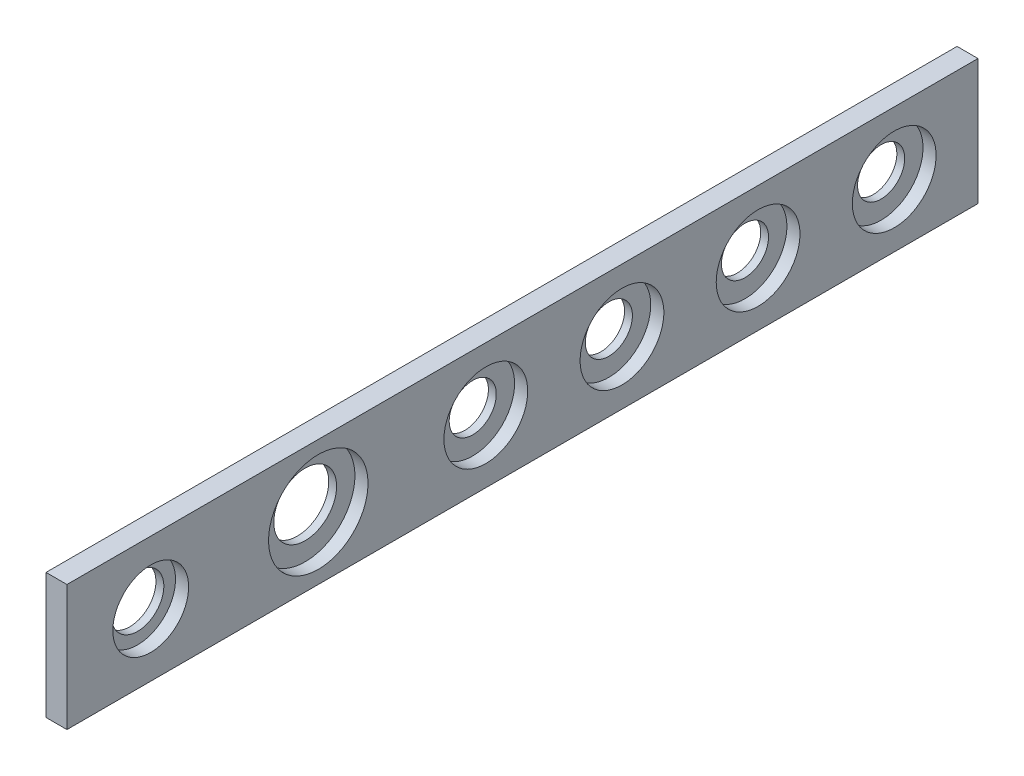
ISO-10303-21;
HEADER;
FILE_DESCRIPTION(('STEP AP214'),'2;1');
FILE_NAME('part.step','',(''),(''),'','','');
FILE_SCHEMA(('AUTOMOTIVE_DESIGN { 1 0 10303 214 1 1 1 1 }'));
ENDSEC;
DATA;
#1=APPLICATION_CONTEXT('core data for automotive mechanical design processes');
#2=APPLICATION_PROTOCOL_DEFINITION('international standard','automotive_design',2000,#1);
#3=PRODUCT_CONTEXT('',#1,'mechanical');
#4=PRODUCT('Part','Part','',(#3));
#5=PRODUCT_RELATED_PRODUCT_CATEGORY('part','',(#4));
#6=PRODUCT_DEFINITION_FORMATION('','',#4);
#7=PRODUCT_DEFINITION_CONTEXT('part definition',#1,'design');
#8=PRODUCT_DEFINITION('design','',#6,#7);
#9=PRODUCT_DEFINITION_SHAPE('','',#8);
#10=(LENGTH_UNIT() NAMED_UNIT(*) SI_UNIT(.MILLI.,.METRE.));
#11=(NAMED_UNIT(*) PLANE_ANGLE_UNIT() SI_UNIT($,.RADIAN.));
#12=(NAMED_UNIT(*) SI_UNIT($,.STERADIAN.) SOLID_ANGLE_UNIT());
#13=UNCERTAINTY_MEASURE_WITH_UNIT(LENGTH_MEASURE(1.E-05),#10,'distance_accuracy_value','');
#14=(GEOMETRIC_REPRESENTATION_CONTEXT(3) GLOBAL_UNCERTAINTY_ASSIGNED_CONTEXT((#13)) GLOBAL_UNIT_ASSIGNED_CONTEXT((#10,
#11,#12)) REPRESENTATION_CONTEXT('',''));
#15=CARTESIAN_POINT('',(0.,0.,0.));
#16=DIRECTION('',(0.,0.,1.));
#17=DIRECTION('',(1.,0.,0.));
#18=AXIS2_PLACEMENT_3D('',#15,#16,#17);
#19=CARTESIAN_POINT('',(0.,0.,1104.9));
#20=DIRECTION('',(0.,-1.,0.));
#21=DIRECTION('',(0.,0.,1.));
#22=AXIS2_PLACEMENT_3D('',#19,#20,#21);
#23=PLANE('',#22);
#24=DIRECTION('',(1.,0.,0.));
#25=VECTOR('',#24,1.);
#26=CARTESIAN_POINT('',(0.,0.,0.));
#27=LINE('',#26,#25);
#28=CARTESIAN_POINT('',(-25.4000000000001,0.,0.));
#29=VERTEX_POINT('',#28);
#30=CARTESIAN_POINT('',(0.,0.,0.));
#31=VERTEX_POINT('',#30);
#32=EDGE_CURVE('E73',#29,#31,#27,.T.);
#33=ORIENTED_EDGE('',*,*,#32,.T.);
#34=DIRECTION('',(0.,0.,-1.));
#35=VECTOR('',#34,1.);
#36=CARTESIAN_POINT('',(0.,0.,1104.9));
#37=LINE('',#36,#35);
#38=CARTESIAN_POINT('',(0.,0.,1104.9));
#39=VERTEX_POINT('',#38);
#40=EDGE_CURVE('E29',#39,#31,#37,.T.);
#41=ORIENTED_EDGE('',*,*,#40,.F.);
#42=DIRECTION('',(1.,0.,0.));
#43=VECTOR('',#42,1.);
#44=CARTESIAN_POINT('',(0.,0.,1104.9));
#45=LINE('',#44,#43);
#46=CARTESIAN_POINT('',(-25.4000000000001,0.,1104.9));
#47=VERTEX_POINT('',#46);
#48=EDGE_CURVE('E95',#47,#39,#45,.T.);
#49=ORIENTED_EDGE('',*,*,#48,.F.);
#50=DIRECTION('',(0.,0.,-1.));
#51=VECTOR('',#50,1.);
#52=CARTESIAN_POINT('',(-25.4000000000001,0.,1104.9));
#53=LINE('',#52,#51);
#54=EDGE_CURVE('E11',#47,#29,#53,.T.);
#55=ORIENTED_EDGE('',*,*,#54,.T.);
#56=EDGE_LOOP('',(#33,#41,#49,#55));
#57=FACE_BOUND('',#56,.T.);
#58=ADVANCED_FACE('F26',(#57),#23,.T.);
#59=CARTESIAN_POINT('',(-25.4000000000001,0.,1104.9));
#60=DIRECTION('',(-1.,0.,0.));
#61=DIRECTION('',(0.,-1.,0.));
#62=AXIS2_PLACEMENT_3D('',#59,#60,#61);
#63=PLANE('',#62);
#64=CARTESIAN_POINT('',(-25.4000000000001,76.2,1003.3));
#65=DIRECTION('',(1.,0.,0.));
#66=DIRECTION('',(0.,-1.,0.));
#67=AXIS2_PLACEMENT_3D('',#64,#65,#66);
#68=CIRCLE('',#67,31.7500000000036);
#69=CARTESIAN_POINT('',(-25.4000000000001,44.4499999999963,1003.3));
#70=VERTEX_POINT('',#69);
#71=EDGE_CURVE('E128',#70,#70,#68,.F.);
#72=ORIENTED_EDGE('',*,*,#71,.F.);
#73=EDGE_LOOP('',(#72));
#74=FACE_BOUND('',#73,.T.);
#75=CARTESIAN_POINT('',(-25.4000000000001,76.2000000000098,800.100000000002));
#76=DIRECTION('',(1.,0.,0.));
#77=DIRECTION('',(0.,-1.,0.));
#78=AXIS2_PLACEMENT_3D('',#75,#76,#77);
#79=CIRCLE('',#78,38.1);
#80=CARTESIAN_POINT('',(-25.4000000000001,38.1000000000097,800.100000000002));
#81=VERTEX_POINT('',#80);
#82=EDGE_CURVE('E132',#81,#81,#79,.F.);
#83=ORIENTED_EDGE('',*,*,#82,.F.);
#84=EDGE_LOOP('',(#83));
#85=FACE_BOUND('',#84,.T.);
#86=CARTESIAN_POINT('',(-25.4000000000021,76.2,596.9));
#87=DIRECTION('',(1.,0.,0.));
#88=DIRECTION('',(0.,-1.,0.));
#89=AXIS2_PLACEMENT_3D('',#86,#87,#88);
#90=CIRCLE('',#89,28.5749999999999);
#91=CARTESIAN_POINT('',(-25.4000000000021,47.625,596.9));
#92=VERTEX_POINT('',#91);
#93=EDGE_CURVE('E136',#92,#92,#90,.F.);
#94=ORIENTED_EDGE('',*,*,#93,.F.);
#95=EDGE_LOOP('',(#94));
#96=FACE_BOUND('',#95,.T.);
#97=CARTESIAN_POINT('',(-25.4000000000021,76.2,431.8));
#98=DIRECTION('',(1.,0.,0.));
#99=DIRECTION('',(0.,-1.,0.));
#100=AXIS2_PLACEMENT_3D('',#97,#98,#99);
#101=CIRCLE('',#100,28.575);
#102=CARTESIAN_POINT('',(-25.4000000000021,47.6249999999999,431.8));
#103=VERTEX_POINT('',#102);
#104=EDGE_CURVE('E140',#103,#103,#101,.F.);
#105=ORIENTED_EDGE('',*,*,#104,.F.);
#106=EDGE_LOOP('',(#105));
#107=FACE_BOUND('',#106,.T.);
#108=CARTESIAN_POINT('',(-25.3999999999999,76.2,266.7));
#109=DIRECTION('',(1.,0.,0.));
#110=DIRECTION('',(0.,-1.,0.));
#111=AXIS2_PLACEMENT_3D('',#108,#109,#110);
#112=CIRCLE('',#111,28.575);
#113=CARTESIAN_POINT('',(-25.3999999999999,47.6249999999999,266.7));
#114=VERTEX_POINT('',#113);
#115=EDGE_CURVE('E144',#114,#114,#112,.F.);
#116=ORIENTED_EDGE('',*,*,#115,.F.);
#117=EDGE_LOOP('',(#116));
#118=FACE_BOUND('',#117,.T.);
#119=CARTESIAN_POINT('',(-25.4000000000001,76.2,101.6));
#120=DIRECTION('',(1.,0.,0.));
#121=DIRECTION('',(0.,-1.,0.));
#122=AXIS2_PLACEMENT_3D('',#119,#120,#121);
#123=CIRCLE('',#122,28.575);
#124=CARTESIAN_POINT('',(-25.4000000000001,47.6249999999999,101.6));
#125=VERTEX_POINT('',#124);
#126=EDGE_CURVE('E147',#125,#125,#123,.F.);
#127=ORIENTED_EDGE('',*,*,#126,.F.);
#128=EDGE_LOOP('',(#127));
#129=FACE_BOUND('',#128,.T.);
#130=DIRECTION('',(0.,-1.,0.));
#131=VECTOR('',#130,1.);
#132=CARTESIAN_POINT('',(-25.4000000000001,0.,0.));
#133=LINE('',#132,#131);
#134=CARTESIAN_POINT('',(-25.4000000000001,152.4,0.));
#135=VERTEX_POINT('',#134);
#136=EDGE_CURVE('E93',#135,#29,#133,.T.);
#137=ORIENTED_EDGE('',*,*,#136,.T.);
#138=ORIENTED_EDGE('',*,*,#54,.F.);
#139=DIRECTION('',(0.,-1.,0.));
#140=VECTOR('',#139,1.);
#141=CARTESIAN_POINT('',(-25.4000000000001,0.,1104.9));
#142=LINE('',#141,#140);
#143=CARTESIAN_POINT('',(-25.4000000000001,152.4,1104.9));
#144=VERTEX_POINT('',#143);
#145=EDGE_CURVE('E42',#144,#47,#142,.T.);
#146=ORIENTED_EDGE('',*,*,#145,.F.);
#147=DIRECTION('',(0.,0.,-1.));
#148=VECTOR('',#147,1.);
#149=CARTESIAN_POINT('',(-25.4000000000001,152.4,1104.9));
#150=LINE('',#149,#148);
#151=EDGE_CURVE('E34',#144,#135,#150,.T.);
#152=ORIENTED_EDGE('',*,*,#151,.T.);
#153=EDGE_LOOP('',(#137,#138,#146,#152));
#154=FACE_BOUND('',#153,.T.);
#155=ADVANCED_FACE('F104',(#74,#85,#96,#107,#118,#129,#154),#63,.T.);
#156=CARTESIAN_POINT('',(-25.4000000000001,152.4,1104.9));
#157=DIRECTION('',(0.,1.,0.));
#158=DIRECTION('',(0.,0.,-1.));
#159=AXIS2_PLACEMENT_3D('',#156,#157,#158);
#160=PLANE('',#159);
#161=DIRECTION('',(-1.,0.,0.));
#162=VECTOR('',#161,1.);
#163=CARTESIAN_POINT('',(-25.4000000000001,152.4,0.));
#164=LINE('',#163,#162);
#165=CARTESIAN_POINT('',(0.,152.4,0.));
#166=VERTEX_POINT('',#165);
#167=EDGE_CURVE('E74',#166,#135,#164,.T.);
#168=ORIENTED_EDGE('',*,*,#167,.T.);
#169=ORIENTED_EDGE('',*,*,#151,.F.);
#170=DIRECTION('',(-1.,0.,0.));
#171=VECTOR('',#170,1.);
#172=CARTESIAN_POINT('',(-25.4000000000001,152.4,1104.9));
#173=LINE('',#172,#171);
#174=CARTESIAN_POINT('',(0.,152.4,1104.9));
#175=VERTEX_POINT('',#174);
#176=EDGE_CURVE('E47',#175,#144,#173,.T.);
#177=ORIENTED_EDGE('',*,*,#176,.F.);
#178=DIRECTION('',(0.,0.,-1.));
#179=VECTOR('',#178,1.);
#180=CARTESIAN_POINT('',(0.,152.4,1104.9));
#181=LINE('',#180,#179);
#182=EDGE_CURVE('E84',#175,#166,#181,.T.);
#183=ORIENTED_EDGE('',*,*,#182,.T.);
#184=EDGE_LOOP('',(#168,#169,#177,#183));
#185=FACE_BOUND('',#184,.T.);
#186=ADVANCED_FACE('F102',(#185),#160,.T.);
#187=CARTESIAN_POINT('',(0.,0.,1104.9));
#188=DIRECTION('',(1.,0.,0.));
#189=DIRECTION('',(0.,0.,1.));
#190=AXIS2_PLACEMENT_3D('',#187,#188,#189);
#191=PLANE('',#190);
#192=CARTESIAN_POINT('',(0.,76.2,1003.3));
#193=DIRECTION('',(-1.,0.,0.));
#194=DIRECTION('',(0.,0.,1.));
#195=AXIS2_PLACEMENT_3D('',#192,#193,#194);
#196=CIRCLE('',#195,45.9740000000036);
#197=CARTESIAN_POINT('',(0.,76.2,1049.27400000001));
#198=VERTEX_POINT('',#197);
#199=EDGE_CURVE('E153',#198,#198,#196,.T.);
#200=ORIENTED_EDGE('',*,*,#199,.T.);
#201=EDGE_LOOP('',(#200));
#202=FACE_BOUND('',#201,.T.);
#203=CARTESIAN_POINT('',(0.,76.2000000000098,800.100000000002));
#204=DIRECTION('',(-1.,0.,0.));
#205=DIRECTION('',(0.,0.,1.));
#206=AXIS2_PLACEMENT_3D('',#203,#204,#205);
#207=CIRCLE('',#206,60.325);
#208=CARTESIAN_POINT('',(0.,76.2000000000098,860.425000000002));
#209=VERTEX_POINT('',#208);
#210=EDGE_CURVE('E164',#209,#209,#207,.T.);
#211=ORIENTED_EDGE('',*,*,#210,.T.);
#212=EDGE_LOOP('',(#211));
#213=FACE_BOUND('',#212,.T.);
#214=CARTESIAN_POINT('',(-2.22044604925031E-12,76.2000000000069,596.9));
#215=DIRECTION('',(-1.,0.,0.));
#216=DIRECTION('',(0.,0.,1.));
#217=AXIS2_PLACEMENT_3D('',#214,#215,#216);
#218=CIRCLE('',#217,50.8);
#219=CARTESIAN_POINT('',(-2.22044604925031E-12,76.2000000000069,647.7));
#220=VERTEX_POINT('',#219);
#221=EDGE_CURVE('E170',#220,#220,#218,.T.);
#222=ORIENTED_EDGE('',*,*,#221,.T.);
#223=EDGE_LOOP('',(#222));
#224=FACE_BOUND('',#223,.T.);
#225=CARTESIAN_POINT('',(-2.22044604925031E-12,76.2000000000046,431.8));
#226=DIRECTION('',(-1.,0.,0.));
#227=DIRECTION('',(0.,0.,1.));
#228=AXIS2_PLACEMENT_3D('',#225,#226,#227);
#229=CIRCLE('',#228,50.8000000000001);
#230=CARTESIAN_POINT('',(-2.22044604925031E-12,76.2000000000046,482.6));
#231=VERTEX_POINT('',#230);
#232=EDGE_CURVE('E176',#231,#231,#229,.T.);
#233=ORIENTED_EDGE('',*,*,#232,.T.);
#234=EDGE_LOOP('',(#233));
#235=FACE_BOUND('',#234,.T.);
#236=CARTESIAN_POINT('',(0.,76.2000000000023,266.7));
#237=DIRECTION('',(-1.,0.,0.));
#238=DIRECTION('',(0.,0.,1.));
#239=AXIS2_PLACEMENT_3D('',#236,#237,#238);
#240=CIRCLE('',#239,50.8);
#241=CARTESIAN_POINT('',(0.,76.2000000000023,317.5));
#242=VERTEX_POINT('',#241);
#243=EDGE_CURVE('E182',#242,#242,#240,.T.);
#244=ORIENTED_EDGE('',*,*,#243,.T.);
#245=EDGE_LOOP('',(#244));
#246=FACE_BOUND('',#245,.T.);
#247=CARTESIAN_POINT('',(0.,76.2,101.6));
#248=DIRECTION('',(-1.,0.,0.));
#249=DIRECTION('',(0.,0.,1.));
#250=AXIS2_PLACEMENT_3D('',#247,#248,#249);
#251=CIRCLE('',#250,50.8);
#252=CARTESIAN_POINT('',(0.,76.2,152.4));
#253=VERTEX_POINT('',#252);
#254=EDGE_CURVE('E88',#253,#253,#251,.T.);
#255=ORIENTED_EDGE('',*,*,#254,.T.);
#256=EDGE_LOOP('',(#255));
#257=FACE_BOUND('',#256,.T.);
#258=DIRECTION('',(0.,1.,0.));
#259=VECTOR('',#258,1.);
#260=CARTESIAN_POINT('',(0.,0.,0.));
#261=LINE('',#260,#259);
#262=EDGE_CURVE('E68',#31,#166,#261,.T.);
#263=ORIENTED_EDGE('',*,*,#262,.T.);
#264=ORIENTED_EDGE('',*,*,#182,.F.);
#265=DIRECTION('',(0.,1.,0.));
#266=VECTOR('',#265,1.);
#267=CARTESIAN_POINT('',(0.,0.,1104.9));
#268=LINE('',#267,#266);
#269=EDGE_CURVE('E81',#39,#175,#268,.T.);
#270=ORIENTED_EDGE('',*,*,#269,.F.);
#271=ORIENTED_EDGE('',*,*,#40,.T.);
#272=EDGE_LOOP('',(#263,#264,#270,#271));
#273=FACE_BOUND('',#272,.T.);
#274=ADVANCED_FACE('F80',(#202,#213,#224,#235,#246,#257,#273),#191,.T.);
#275=CARTESIAN_POINT('',(0.,0.,1104.9));
#276=DIRECTION('',(0.,0.,1.));
#277=DIRECTION('',(-1.,0.,0.));
#278=AXIS2_PLACEMENT_3D('',#275,#276,#277);
#279=PLANE('',#278);
#280=ORIENTED_EDGE('',*,*,#48,.T.);
#281=ORIENTED_EDGE('',*,*,#269,.T.);
#282=ORIENTED_EDGE('',*,*,#176,.T.);
#283=ORIENTED_EDGE('',*,*,#145,.T.);
#284=EDGE_LOOP('',(#280,#281,#282,#283));
#285=FACE_BOUND('',#284,.T.);
#286=ADVANCED_FACE('F105',(#285),#279,.T.);
#287=CARTESIAN_POINT('',(0.,0.,0.));
#288=DIRECTION('',(0.,0.,1.));
#289=DIRECTION('',(-1.,0.,0.));
#290=AXIS2_PLACEMENT_3D('',#287,#288,#289);
#291=PLANE('',#290);
#292=ORIENTED_EDGE('',*,*,#32,.F.);
#293=ORIENTED_EDGE('',*,*,#136,.F.);
#294=ORIENTED_EDGE('',*,*,#167,.F.);
#295=ORIENTED_EDGE('',*,*,#262,.F.);
#296=EDGE_LOOP('',(#292,#293,#294,#295));
#297=FACE_BOUND('',#296,.T.);
#298=ADVANCED_FACE('F70',(#297),#291,.F.);
#299=CARTESIAN_POINT('',(-15.8750000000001,76.2,101.6));
#300=DIRECTION('',(1.,0.,0.));
#301=DIRECTION('',(0.,0.,1.));
#302=AXIS2_PLACEMENT_3D('',#299,#300,#301);
#303=CYLINDRICAL_SURFACE('',#302,50.8);
#304=CARTESIAN_POINT('',(-15.8750000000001,76.2,101.6));
#305=DIRECTION('',(-1.,0.,0.));
#306=DIRECTION('',(0.,0.,1.));
#307=AXIS2_PLACEMENT_3D('',#304,#305,#306);
#308=CIRCLE('',#307,50.8);
#309=CARTESIAN_POINT('',(-15.8750000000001,76.2,152.4));
#310=VERTEX_POINT('',#309);
#311=EDGE_CURVE('E85',#310,#310,#308,.T.);
#312=ORIENTED_EDGE('',*,*,#311,.T.);
#313=EDGE_LOOP('',(#312));
#314=FACE_BOUND('',#313,.T.);
#315=ORIENTED_EDGE('',*,*,#254,.F.);
#316=EDGE_LOOP('',(#315));
#317=FACE_BOUND('',#316,.T.);
#318=ADVANCED_FACE('F112',(#314,#317),#303,.F.);
#319=CARTESIAN_POINT('',(-15.8750000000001,76.2,101.6));
#320=DIRECTION('',(1.,0.,0.));
#321=DIRECTION('',(0.,0.,1.));
#322=AXIS2_PLACEMENT_3D('',#319,#320,#321);
#323=PLANE('',#322);
#324=CARTESIAN_POINT('',(-15.8750000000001,76.2,101.6));
#325=DIRECTION('',(-1.,0.,0.));
#326=DIRECTION('',(0.,0.,1.));
#327=AXIS2_PLACEMENT_3D('',#324,#325,#326);
#328=CIRCLE('',#327,28.575);
#329=CARTESIAN_POINT('',(-15.8750000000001,76.2,130.175));
#330=VERTEX_POINT('',#329);
#331=EDGE_CURVE('E149',#330,#330,#328,.T.);
#332=ORIENTED_EDGE('',*,*,#331,.T.);
#333=EDGE_LOOP('',(#332));
#334=FACE_BOUND('',#333,.T.);
#335=ORIENTED_EDGE('',*,*,#311,.F.);
#336=EDGE_LOOP('',(#335));
#337=FACE_BOUND('',#336,.T.);
#338=ADVANCED_FACE('F192',(#334,#337),#323,.T.);
#339=CARTESIAN_POINT('',(-15.8749999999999,76.2000000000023,266.7));
#340=DIRECTION('',(1.,0.,0.));
#341=DIRECTION('',(0.,0.,1.));
#342=AXIS2_PLACEMENT_3D('',#339,#340,#341);
#343=CYLINDRICAL_SURFACE('',#342,50.8);
#344=CARTESIAN_POINT('',(-15.8749999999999,76.2000000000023,266.7));
#345=DIRECTION('',(-1.,0.,0.));
#346=DIRECTION('',(0.,0.,1.));
#347=AXIS2_PLACEMENT_3D('',#344,#345,#346);
#348=CIRCLE('',#347,50.8);
#349=CARTESIAN_POINT('',(-15.8749999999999,76.2000000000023,317.5));
#350=VERTEX_POINT('',#349);
#351=EDGE_CURVE('E185',#350,#350,#348,.T.);
#352=ORIENTED_EDGE('',*,*,#351,.T.);
#353=EDGE_LOOP('',(#352));
#354=FACE_BOUND('',#353,.T.);
#355=ORIENTED_EDGE('',*,*,#243,.F.);
#356=EDGE_LOOP('',(#355));
#357=FACE_BOUND('',#356,.T.);
#358=ADVANCED_FACE('F198',(#354,#357),#343,.F.);
#359=CARTESIAN_POINT('',(-15.8749999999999,76.2000000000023,266.7));
#360=DIRECTION('',(1.,0.,0.));
#361=DIRECTION('',(0.,0.,1.));
#362=AXIS2_PLACEMENT_3D('',#359,#360,#361);
#363=PLANE('',#362);
#364=CARTESIAN_POINT('',(-15.8749999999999,76.2,266.7));
#365=DIRECTION('',(-1.,0.,0.));
#366=DIRECTION('',(0.,0.,1.));
#367=AXIS2_PLACEMENT_3D('',#364,#365,#366);
#368=CIRCLE('',#367,28.575);
#369=CARTESIAN_POINT('',(-15.8749999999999,76.2,295.275));
#370=VERTEX_POINT('',#369);
#371=EDGE_CURVE('E150',#370,#370,#368,.T.);
#372=ORIENTED_EDGE('',*,*,#371,.T.);
#373=EDGE_LOOP('',(#372));
#374=FACE_BOUND('',#373,.T.);
#375=ORIENTED_EDGE('',*,*,#351,.F.);
#376=EDGE_LOOP('',(#375));
#377=FACE_BOUND('',#376,.T.);
#378=ADVANCED_FACE('F204',(#374,#377),#363,.T.);
#379=CARTESIAN_POINT('',(-15.8750000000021,76.2000000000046,431.8));
#380=DIRECTION('',(1.,0.,0.));
#381=DIRECTION('',(0.,0.,1.));
#382=AXIS2_PLACEMENT_3D('',#379,#380,#381);
#383=CYLINDRICAL_SURFACE('',#382,50.8000000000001);
#384=CARTESIAN_POINT('',(-15.8750000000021,76.2000000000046,431.8));
#385=DIRECTION('',(-1.,0.,0.));
#386=DIRECTION('',(0.,0.,1.));
#387=AXIS2_PLACEMENT_3D('',#384,#385,#386);
#388=CIRCLE('',#387,50.8000000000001);
#389=CARTESIAN_POINT('',(-15.8750000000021,76.2000000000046,482.6));
#390=VERTEX_POINT('',#389);
#391=EDGE_CURVE('E179',#390,#390,#388,.T.);
#392=ORIENTED_EDGE('',*,*,#391,.T.);
#393=EDGE_LOOP('',(#392));
#394=FACE_BOUND('',#393,.T.);
#395=ORIENTED_EDGE('',*,*,#232,.F.);
#396=EDGE_LOOP('',(#395));
#397=FACE_BOUND('',#396,.T.);
#398=ADVANCED_FACE('F208',(#394,#397),#383,.F.);
#399=CARTESIAN_POINT('',(-15.8750000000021,76.2000000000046,431.8));
#400=DIRECTION('',(1.,0.,0.));
#401=DIRECTION('',(0.,0.,1.));
#402=AXIS2_PLACEMENT_3D('',#399,#400,#401);
#403=PLANE('',#402);
#404=CARTESIAN_POINT('',(-15.8750000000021,76.2,431.8));
#405=DIRECTION('',(-1.,0.,0.));
#406=DIRECTION('',(0.,0.,1.));
#407=AXIS2_PLACEMENT_3D('',#404,#405,#406);
#408=CIRCLE('',#407,28.575);
#409=CARTESIAN_POINT('',(-15.8750000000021,76.2,460.375));
#410=VERTEX_POINT('',#409);
#411=EDGE_CURVE('E280',#410,#410,#408,.T.);
#412=ORIENTED_EDGE('',*,*,#411,.T.);
#413=EDGE_LOOP('',(#412));
#414=FACE_BOUND('',#413,.T.);
#415=ORIENTED_EDGE('',*,*,#391,.F.);
#416=EDGE_LOOP('',(#415));
#417=FACE_BOUND('',#416,.T.);
#418=ADVANCED_FACE('F212',(#414,#417),#403,.T.);
#419=CARTESIAN_POINT('',(-15.8750000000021,76.2000000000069,596.9));
#420=DIRECTION('',(1.,0.,0.));
#421=DIRECTION('',(0.,0.,1.));
#422=AXIS2_PLACEMENT_3D('',#419,#420,#421);
#423=CYLINDRICAL_SURFACE('',#422,50.8);
#424=CARTESIAN_POINT('',(-15.8750000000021,76.2000000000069,596.9));
#425=DIRECTION('',(-1.,0.,0.));
#426=DIRECTION('',(0.,0.,1.));
#427=AXIS2_PLACEMENT_3D('',#424,#425,#426);
#428=CIRCLE('',#427,50.8);
#429=CARTESIAN_POINT('',(-15.8750000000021,76.2000000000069,647.7));
#430=VERTEX_POINT('',#429);
#431=EDGE_CURVE('E173',#430,#430,#428,.T.);
#432=ORIENTED_EDGE('',*,*,#431,.T.);
#433=EDGE_LOOP('',(#432));
#434=FACE_BOUND('',#433,.T.);
#435=ORIENTED_EDGE('',*,*,#221,.F.);
#436=EDGE_LOOP('',(#435));
#437=FACE_BOUND('',#436,.T.);
#438=ADVANCED_FACE('F216',(#434,#437),#423,.F.);
#439=CARTESIAN_POINT('',(-15.8750000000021,76.2000000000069,596.9));
#440=DIRECTION('',(1.,0.,0.));
#441=DIRECTION('',(0.,0.,1.));
#442=AXIS2_PLACEMENT_3D('',#439,#440,#441);
#443=PLANE('',#442);
#444=CARTESIAN_POINT('',(-15.8750000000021,76.2,596.9));
#445=DIRECTION('',(-1.,0.,0.));
#446=DIRECTION('',(0.,0.,1.));
#447=AXIS2_PLACEMENT_3D('',#444,#445,#446);
#448=CIRCLE('',#447,28.5749999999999);
#449=CARTESIAN_POINT('',(-15.8750000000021,76.2,625.475));
#450=VERTEX_POINT('',#449);
#451=EDGE_CURVE('E276',#450,#450,#448,.T.);
#452=ORIENTED_EDGE('',*,*,#451,.T.);
#453=EDGE_LOOP('',(#452));
#454=FACE_BOUND('',#453,.T.);
#455=ORIENTED_EDGE('',*,*,#431,.F.);
#456=EDGE_LOOP('',(#455));
#457=FACE_BOUND('',#456,.T.);
#458=ADVANCED_FACE('F220',(#454,#457),#443,.T.);
#459=CARTESIAN_POINT('',(-15.8750000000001,76.2000000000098,800.100000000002));
#460=DIRECTION('',(1.,0.,0.));
#461=DIRECTION('',(0.,0.,1.));
#462=AXIS2_PLACEMENT_3D('',#459,#460,#461);
#463=CYLINDRICAL_SURFACE('',#462,60.325);
#464=CARTESIAN_POINT('',(-15.8750000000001,76.2000000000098,800.100000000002));
#465=DIRECTION('',(-1.,0.,0.));
#466=DIRECTION('',(0.,0.,1.));
#467=AXIS2_PLACEMENT_3D('',#464,#465,#466);
#468=CIRCLE('',#467,60.325);
#469=CARTESIAN_POINT('',(-15.8750000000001,76.2000000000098,860.425000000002));
#470=VERTEX_POINT('',#469);
#471=EDGE_CURVE('E167',#470,#470,#468,.T.);
#472=ORIENTED_EDGE('',*,*,#471,.T.);
#473=EDGE_LOOP('',(#472));
#474=FACE_BOUND('',#473,.T.);
#475=ORIENTED_EDGE('',*,*,#210,.F.);
#476=EDGE_LOOP('',(#475));
#477=FACE_BOUND('',#476,.T.);
#478=ADVANCED_FACE('F224',(#474,#477),#463,.F.);
#479=CARTESIAN_POINT('',(-15.8750000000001,76.2000000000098,800.100000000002));
#480=DIRECTION('',(1.,0.,0.));
#481=DIRECTION('',(0.,0.,1.));
#482=AXIS2_PLACEMENT_3D('',#479,#480,#481);
#483=PLANE('',#482);
#484=CARTESIAN_POINT('',(-15.8750000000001,76.2000000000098,800.100000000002));
#485=DIRECTION('',(-1.,0.,0.));
#486=DIRECTION('',(0.,0.,1.));
#487=AXIS2_PLACEMENT_3D('',#484,#485,#486);
#488=CIRCLE('',#487,38.1);
#489=CARTESIAN_POINT('',(-15.8750000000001,76.2000000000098,838.200000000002));
#490=VERTEX_POINT('',#489);
#491=EDGE_CURVE('E270',#490,#490,#488,.T.);
#492=ORIENTED_EDGE('',*,*,#491,.T.);
#493=EDGE_LOOP('',(#492));
#494=FACE_BOUND('',#493,.T.);
#495=ORIENTED_EDGE('',*,*,#471,.F.);
#496=EDGE_LOOP('',(#495));
#497=FACE_BOUND('',#496,.T.);
#498=ADVANCED_FACE('F228',(#494,#497),#483,.T.);
#499=CARTESIAN_POINT('',(-15.8750000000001,76.2,1003.3));
#500=DIRECTION('',(1.,0.,0.));
#501=DIRECTION('',(0.,0.,1.));
#502=AXIS2_PLACEMENT_3D('',#499,#500,#501);
#503=CYLINDRICAL_SURFACE('',#502,45.9740000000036);
#504=CARTESIAN_POINT('',(-15.8750000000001,76.2,1003.3));
#505=DIRECTION('',(-1.,0.,0.));
#506=DIRECTION('',(0.,0.,1.));
#507=AXIS2_PLACEMENT_3D('',#504,#505,#506);
#508=CIRCLE('',#507,45.9740000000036);
#509=CARTESIAN_POINT('',(-15.8750000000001,76.2,1049.27400000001));
#510=VERTEX_POINT('',#509);
#511=EDGE_CURVE('E161',#510,#510,#508,.T.);
#512=ORIENTED_EDGE('',*,*,#511,.T.);
#513=EDGE_LOOP('',(#512));
#514=FACE_BOUND('',#513,.T.);
#515=ORIENTED_EDGE('',*,*,#199,.F.);
#516=EDGE_LOOP('',(#515));
#517=FACE_BOUND('',#516,.T.);
#518=ADVANCED_FACE('F232',(#514,#517),#503,.F.);
#519=CARTESIAN_POINT('',(-15.8750000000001,76.2,1003.3));
#520=DIRECTION('',(1.,0.,0.));
#521=DIRECTION('',(0.,0.,1.));
#522=AXIS2_PLACEMENT_3D('',#519,#520,#521);
#523=PLANE('',#522);
#524=CARTESIAN_POINT('',(-15.8750000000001,76.2,1003.3));
#525=DIRECTION('',(-1.,0.,0.));
#526=DIRECTION('',(0.,0.,1.));
#527=AXIS2_PLACEMENT_3D('',#524,#525,#526);
#528=CIRCLE('',#527,31.7500000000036);
#529=CARTESIAN_POINT('',(-15.8750000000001,76.2,1035.05000000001));
#530=VERTEX_POINT('',#529);
#531=EDGE_CURVE('E268',#530,#530,#528,.T.);
#532=ORIENTED_EDGE('',*,*,#531,.T.);
#533=EDGE_LOOP('',(#532));
#534=FACE_BOUND('',#533,.T.);
#535=ORIENTED_EDGE('',*,*,#511,.F.);
#536=EDGE_LOOP('',(#535));
#537=FACE_BOUND('',#536,.T.);
#538=ADVANCED_FACE('F236',(#534,#537),#523,.T.);
#539=CARTESIAN_POINT('',(-25.401,76.2,101.6));
#540=DIRECTION('',(1.,0.,0.));
#541=DIRECTION('',(0.,0.,1.));
#542=AXIS2_PLACEMENT_3D('',#539,#540,#541);
#543=CYLINDRICAL_SURFACE('',#542,28.575);
#544=ORIENTED_EDGE('',*,*,#126,.T.);
#545=EDGE_LOOP('',(#544));
#546=FACE_BOUND('',#545,.T.);
#547=ORIENTED_EDGE('',*,*,#331,.F.);
#548=EDGE_LOOP('',(#547));
#549=FACE_BOUND('',#548,.T.);
#550=ADVANCED_FACE('F240',(#546,#549),#543,.F.);
#551=CARTESIAN_POINT('',(-25.401,76.2,266.7));
#552=DIRECTION('',(1.,0.,0.));
#553=DIRECTION('',(0.,0.,1.));
#554=AXIS2_PLACEMENT_3D('',#551,#552,#553);
#555=CYLINDRICAL_SURFACE('',#554,28.575);
#556=ORIENTED_EDGE('',*,*,#115,.T.);
#557=EDGE_LOOP('',(#556));
#558=FACE_BOUND('',#557,.T.);
#559=ORIENTED_EDGE('',*,*,#371,.F.);
#560=EDGE_LOOP('',(#559));
#561=FACE_BOUND('',#560,.T.);
#562=ADVANCED_FACE('F244',(#558,#561),#555,.F.);
#563=CARTESIAN_POINT('',(-25.4010000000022,76.2,431.8));
#564=DIRECTION('',(1.,0.,0.));
#565=DIRECTION('',(0.,0.,1.));
#566=AXIS2_PLACEMENT_3D('',#563,#564,#565);
#567=CYLINDRICAL_SURFACE('',#566,28.575);
#568=ORIENTED_EDGE('',*,*,#104,.T.);
#569=EDGE_LOOP('',(#568));
#570=FACE_BOUND('',#569,.T.);
#571=ORIENTED_EDGE('',*,*,#411,.F.);
#572=EDGE_LOOP('',(#571));
#573=FACE_BOUND('',#572,.T.);
#574=ADVANCED_FACE('F247',(#570,#573),#567,.F.);
#575=CARTESIAN_POINT('',(-25.4010000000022,76.2,596.9));
#576=DIRECTION('',(1.,0.,0.));
#577=DIRECTION('',(0.,0.,1.));
#578=AXIS2_PLACEMENT_3D('',#575,#576,#577);
#579=CYLINDRICAL_SURFACE('',#578,28.5749999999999);
#580=ORIENTED_EDGE('',*,*,#93,.T.);
#581=EDGE_LOOP('',(#580));
#582=FACE_BOUND('',#581,.T.);
#583=ORIENTED_EDGE('',*,*,#451,.F.);
#584=EDGE_LOOP('',(#583));
#585=FACE_BOUND('',#584,.T.);
#586=ADVANCED_FACE('F251',(#582,#585),#579,.F.);
#587=CARTESIAN_POINT('',(-25.401,76.2000000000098,800.100000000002));
#588=DIRECTION('',(1.,0.,0.));
#589=DIRECTION('',(0.,0.,1.));
#590=AXIS2_PLACEMENT_3D('',#587,#588,#589);
#591=CYLINDRICAL_SURFACE('',#590,38.1);
#592=ORIENTED_EDGE('',*,*,#82,.T.);
#593=EDGE_LOOP('',(#592));
#594=FACE_BOUND('',#593,.T.);
#595=ORIENTED_EDGE('',*,*,#491,.F.);
#596=EDGE_LOOP('',(#595));
#597=FACE_BOUND('',#596,.T.);
#598=ADVANCED_FACE('F255',(#594,#597),#591,.F.);
#599=CARTESIAN_POINT('',(-25.401,76.2,1003.3));
#600=DIRECTION('',(1.,0.,0.));
#601=DIRECTION('',(0.,0.,1.));
#602=AXIS2_PLACEMENT_3D('',#599,#600,#601);
#603=CYLINDRICAL_SURFACE('',#602,31.7500000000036);
#604=ORIENTED_EDGE('',*,*,#71,.T.);
#605=EDGE_LOOP('',(#604));
#606=FACE_BOUND('',#605,.T.);
#607=ORIENTED_EDGE('',*,*,#531,.F.);
#608=EDGE_LOOP('',(#607));
#609=FACE_BOUND('',#608,.T.);
#610=ADVANCED_FACE('F259',(#606,#609),#603,.F.);
#611=CLOSED_SHELL('',(#58,#155,#186,#274,#286,#298,#318,#338,#358,#378,#398,#418,#438,#458,#478,
#498,#518,#538,#550,#562,#574,#586,#598,#610));
#612=MANIFOLD_SOLID_BREP('B2',#611);
#613=ADVANCED_BREP_SHAPE_REPRESENTATION('',(#18,#612),#14);
#614=SHAPE_DEFINITION_REPRESENTATION(#9,#613);
ENDSEC;
END-ISO-10303-21;
